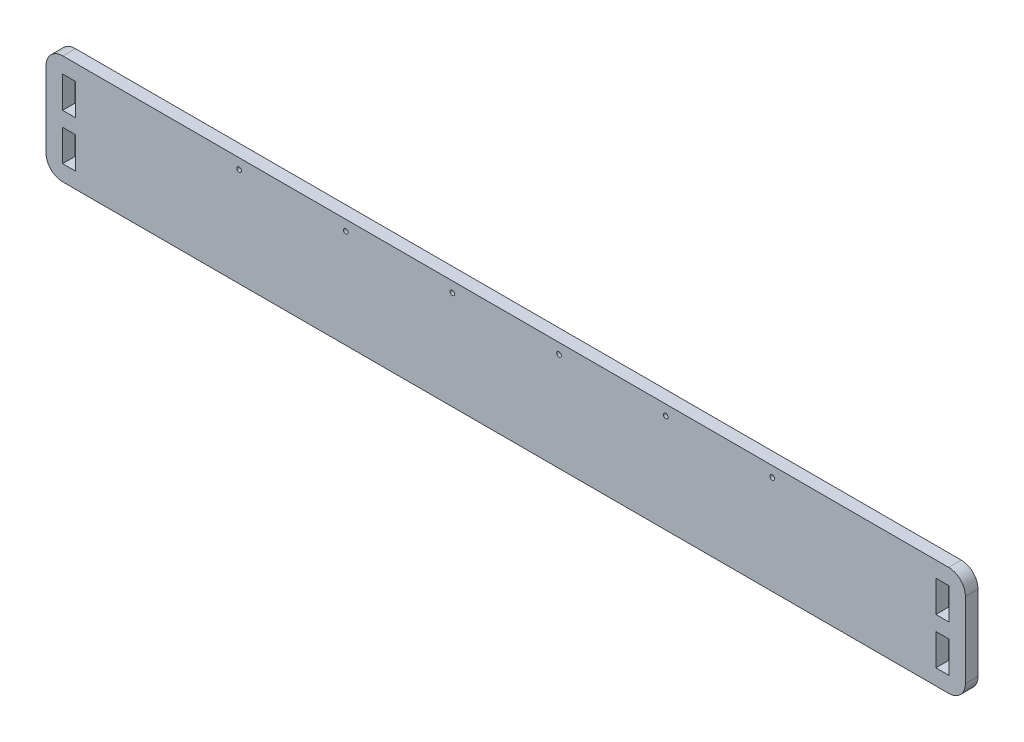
ISO-10303-21;
HEADER;
FILE_DESCRIPTION(('STEP AP214'),'2;1');
FILE_NAME('part.step','',(''),(''),'','','');
FILE_SCHEMA(('AUTOMOTIVE_DESIGN { 1 0 10303 214 1 1 1 1 }'));
ENDSEC;
DATA;
#1=APPLICATION_CONTEXT('core data for automotive mechanical design processes');
#2=APPLICATION_PROTOCOL_DEFINITION('international standard','automotive_design',2000,#1);
#3=PRODUCT_CONTEXT('',#1,'mechanical');
#4=PRODUCT('Part','Part','',(#3));
#5=PRODUCT_RELATED_PRODUCT_CATEGORY('part','',(#4));
#6=PRODUCT_DEFINITION_FORMATION('','',#4);
#7=PRODUCT_DEFINITION_CONTEXT('part definition',#1,'design');
#8=PRODUCT_DEFINITION('design','',#6,#7);
#9=PRODUCT_DEFINITION_SHAPE('','',#8);
#10=(LENGTH_UNIT() NAMED_UNIT(*) SI_UNIT(.MILLI.,.METRE.));
#11=(NAMED_UNIT(*) PLANE_ANGLE_UNIT() SI_UNIT($,.RADIAN.));
#12=(NAMED_UNIT(*) SI_UNIT($,.STERADIAN.) SOLID_ANGLE_UNIT());
#13=UNCERTAINTY_MEASURE_WITH_UNIT(LENGTH_MEASURE(1.E-05),#10,'distance_accuracy_value','');
#14=(GEOMETRIC_REPRESENTATION_CONTEXT(3) GLOBAL_UNCERTAINTY_ASSIGNED_CONTEXT((#13)) GLOBAL_UNIT_ASSIGNED_CONTEXT((#10,
#11,#12)) REPRESENTATION_CONTEXT('',''));
#15=CARTESIAN_POINT('',(0.,0.,0.));
#16=DIRECTION('',(0.,0.,1.));
#17=DIRECTION('',(1.,0.,0.));
#18=AXIS2_PLACEMENT_3D('',#15,#16,#17);
#19=CARTESIAN_POINT('',(-219.,60.,6.));
#20=DIRECTION('',(1.,0.,0.));
#21=DIRECTION('',(0.,0.,-1.));
#22=AXIS2_PLACEMENT_3D('',#19,#20,#21);
#23=PLANE('',#22);
#24=DIRECTION('',(0.,-1.,0.));
#25=VECTOR('',#24,1.);
#26=CARTESIAN_POINT('',(-219.,60.,0.));
#27=LINE('',#26,#25);
#28=CARTESIAN_POINT('',(-219.,52.,0.));
#29=VERTEX_POINT('',#28);
#30=CARTESIAN_POINT('',(-219.,16.,0.));
#31=VERTEX_POINT('',#30);
#32=EDGE_CURVE('E335',#29,#31,#27,.T.);
#33=ORIENTED_EDGE('',*,*,#32,.T.);
#34=DIRECTION('',(0.,0.,-1.));
#35=VECTOR('',#34,1.);
#36=CARTESIAN_POINT('',(-219.,16.,6.));
#37=LINE('',#36,#35);
#38=CARTESIAN_POINT('',(-219.,16.,6.));
#39=VERTEX_POINT('',#38);
#40=EDGE_CURVE('E12',#31,#39,#37,.F.);
#41=ORIENTED_EDGE('',*,*,#40,.T.);
#42=DIRECTION('',(0.,-1.,0.));
#43=VECTOR('',#42,1.);
#44=CARTESIAN_POINT('',(-219.,60.,6.));
#45=LINE('',#44,#43);
#46=CARTESIAN_POINT('',(-219.,52.,6.));
#47=VERTEX_POINT('',#46);
#48=EDGE_CURVE('E342',#47,#39,#45,.T.);
#49=ORIENTED_EDGE('',*,*,#48,.F.);
#50=DIRECTION('',(0.,0.,-1.));
#51=VECTOR('',#50,1.);
#52=CARTESIAN_POINT('',(-219.,52.,6.));
#53=LINE('',#52,#51);
#54=EDGE_CURVE('E44',#47,#29,#53,.T.);
#55=ORIENTED_EDGE('',*,*,#54,.T.);
#56=EDGE_LOOP('',(#33,#41,#49,#55));
#57=FACE_BOUND('',#56,.T.);
#58=ADVANCED_FACE('F36',(#57),#23,.F.);
#59=CARTESIAN_POINT('',(-219.,7.99999999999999,6.));
#60=DIRECTION('',(0.,1.,0.));
#61=DIRECTION('',(0.,0.,1.));
#62=AXIS2_PLACEMENT_3D('',#59,#60,#61);
#63=PLANE('',#62);
#64=DIRECTION('',(1.,0.,0.));
#65=VECTOR('',#64,1.);
#66=CARTESIAN_POINT('',(-219.,7.99999999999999,0.));
#67=LINE('',#66,#65);
#68=CARTESIAN_POINT('',(-211.,7.99999999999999,0.));
#69=VERTEX_POINT('',#68);
#70=CARTESIAN_POINT('',(211.,7.99999999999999,0.));
#71=VERTEX_POINT('',#70);
#72=EDGE_CURVE('E356',#69,#71,#67,.T.);
#73=ORIENTED_EDGE('',*,*,#72,.T.);
#74=DIRECTION('',(0.,0.,-1.));
#75=VECTOR('',#74,1.);
#76=CARTESIAN_POINT('',(211.,7.99999999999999,6.));
#77=LINE('',#76,#75);
#78=CARTESIAN_POINT('',(211.,7.99999999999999,6.));
#79=VERTEX_POINT('',#78);
#80=EDGE_CURVE('E51',#71,#79,#77,.F.);
#81=ORIENTED_EDGE('',*,*,#80,.T.);
#82=DIRECTION('',(1.,0.,0.));
#83=VECTOR('',#82,1.);
#84=CARTESIAN_POINT('',(-219.,7.99999999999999,6.));
#85=LINE('',#84,#83);
#86=CARTESIAN_POINT('',(-211.,7.99999999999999,6.));
#87=VERTEX_POINT('',#86);
#88=EDGE_CURVE('E344',#87,#79,#85,.T.);
#89=ORIENTED_EDGE('',*,*,#88,.F.);
#90=DIRECTION('',(0.,0.,-1.));
#91=VECTOR('',#90,1.);
#92=CARTESIAN_POINT('',(-211.,7.99999999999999,6.));
#93=LINE('',#92,#91);
#94=EDGE_CURVE('E387',#87,#69,#93,.T.);
#95=ORIENTED_EDGE('',*,*,#94,.T.);
#96=EDGE_LOOP('',(#73,#81,#89,#95));
#97=FACE_BOUND('',#96,.T.);
#98=ADVANCED_FACE('F404',(#97),#63,.F.);
#99=CARTESIAN_POINT('',(219.,60.,6.));
#100=DIRECTION('',(-1.,0.,0.));
#101=DIRECTION('',(0.,0.,1.));
#102=AXIS2_PLACEMENT_3D('',#99,#100,#101);
#103=PLANE('',#102);
#104=DIRECTION('',(0.,1.,0.));
#105=VECTOR('',#104,1.);
#106=CARTESIAN_POINT('',(219.,60.,0.));
#107=LINE('',#106,#105);
#108=CARTESIAN_POINT('',(219.,16.,0.));
#109=VERTEX_POINT('',#108);
#110=CARTESIAN_POINT('',(219.,52.,0.));
#111=VERTEX_POINT('',#110);
#112=EDGE_CURVE('E358',#109,#111,#107,.T.);
#113=ORIENTED_EDGE('',*,*,#112,.T.);
#114=DIRECTION('',(0.,0.,-1.));
#115=VECTOR('',#114,1.);
#116=CARTESIAN_POINT('',(219.,52.,6.));
#117=LINE('',#116,#115);
#118=CARTESIAN_POINT('',(219.,52.,6.));
#119=VERTEX_POINT('',#118);
#120=EDGE_CURVE('E378',#111,#119,#117,.F.);
#121=ORIENTED_EDGE('',*,*,#120,.T.);
#122=DIRECTION('',(0.,1.,0.));
#123=VECTOR('',#122,1.);
#124=CARTESIAN_POINT('',(219.,60.,6.));
#125=LINE('',#124,#123);
#126=CARTESIAN_POINT('',(219.,16.,6.));
#127=VERTEX_POINT('',#126);
#128=EDGE_CURVE('E347',#127,#119,#125,.T.);
#129=ORIENTED_EDGE('',*,*,#128,.F.);
#130=DIRECTION('',(0.,0.,-1.));
#131=VECTOR('',#130,1.);
#132=CARTESIAN_POINT('',(219.,16.,6.));
#133=LINE('',#132,#131);
#134=EDGE_CURVE('E375',#127,#109,#133,.T.);
#135=ORIENTED_EDGE('',*,*,#134,.T.);
#136=EDGE_LOOP('',(#113,#121,#129,#135));
#137=FACE_BOUND('',#136,.T.);
#138=ADVANCED_FACE('F413',(#137),#103,.F.);
#139=CARTESIAN_POINT('',(-219.,60.,6.));
#140=DIRECTION('',(0.,-1.,0.));
#141=DIRECTION('',(0.,0.,-1.));
#142=AXIS2_PLACEMENT_3D('',#139,#140,#141);
#143=PLANE('',#142);
#144=DIRECTION('',(-1.,0.,0.));
#145=VECTOR('',#144,1.);
#146=CARTESIAN_POINT('',(-219.,60.,6.));
#147=LINE('',#146,#145);
#148=CARTESIAN_POINT('',(211.,60.,6.));
#149=VERTEX_POINT('',#148);
#150=CARTESIAN_POINT('',(-211.,60.,6.));
#151=VERTEX_POINT('',#150);
#152=EDGE_CURVE('E350',#149,#151,#147,.T.);
#153=ORIENTED_EDGE('',*,*,#152,.F.);
#154=DIRECTION('',(0.,0.,-1.));
#155=VECTOR('',#154,1.);
#156=CARTESIAN_POINT('',(211.,60.,6.));
#157=LINE('',#156,#155);
#158=CARTESIAN_POINT('',(211.,60.,0.));
#159=VERTEX_POINT('',#158);
#160=EDGE_CURVE('E364',#149,#159,#157,.T.);
#161=ORIENTED_EDGE('',*,*,#160,.T.);
#162=DIRECTION('',(-1.,0.,0.));
#163=VECTOR('',#162,1.);
#164=CARTESIAN_POINT('',(-219.,60.,0.));
#165=LINE('',#164,#163);
#166=CARTESIAN_POINT('',(-211.,60.,0.));
#167=VERTEX_POINT('',#166);
#168=EDGE_CURVE('E345',#159,#167,#165,.T.);
#169=ORIENTED_EDGE('',*,*,#168,.T.);
#170=DIRECTION('',(0.,0.,-1.));
#171=VECTOR('',#170,1.);
#172=CARTESIAN_POINT('',(-211.,60.,6.));
#173=LINE('',#172,#171);
#174=EDGE_CURVE('E353',#167,#151,#173,.F.);
#175=ORIENTED_EDGE('',*,*,#174,.T.);
#176=EDGE_LOOP('',(#153,#161,#169,#175));
#177=FACE_BOUND('',#176,.T.);
#178=ADVANCED_FACE('F421',(#177),#143,.F.);
#179=CARTESIAN_POINT('',(0.,0.,6.));
#180=DIRECTION('',(0.,0.,1.));
#181=DIRECTION('',(1.,0.,0.));
#182=AXIS2_PLACEMENT_3D('',#179,#180,#181);
#183=PLANE('',#182);
#184=CARTESIAN_POINT('',(127.,55.06276,6.));
#185=DIRECTION('',(0.,0.,-1.));
#186=DIRECTION('',(-1.,0.,0.));
#187=AXIS2_PLACEMENT_3D('',#184,#185,#186);
#188=CIRCLE('',#187,1.09999999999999);
#189=CARTESIAN_POINT('',(125.9,55.06276,6.));
#190=VERTEX_POINT('',#189);
#191=EDGE_CURVE('E295',#190,#190,#188,.T.);
#192=ORIENTED_EDGE('',*,*,#191,.T.);
#193=EDGE_LOOP('',(#192));
#194=FACE_BOUND('',#193,.T.);
#195=CARTESIAN_POINT('',(76.2,55.06276,6.));
#196=DIRECTION('',(0.,0.,-1.));
#197=DIRECTION('',(-1.,0.,0.));
#198=AXIS2_PLACEMENT_3D('',#195,#196,#197);
#199=CIRCLE('',#198,1.10000000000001);
#200=CARTESIAN_POINT('',(75.1,55.06276,6.));
#201=VERTEX_POINT('',#200);
#202=EDGE_CURVE('E757',#201,#201,#199,.T.);
#203=ORIENTED_EDGE('',*,*,#202,.T.);
#204=EDGE_LOOP('',(#203));
#205=FACE_BOUND('',#204,.T.);
#206=CARTESIAN_POINT('',(25.4,55.06276,6.));
#207=DIRECTION('',(0.,0.,-1.));
#208=DIRECTION('',(-1.,0.,0.));
#209=AXIS2_PLACEMENT_3D('',#206,#207,#208);
#210=CIRCLE('',#209,1.10000000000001);
#211=CARTESIAN_POINT('',(24.3,55.06276,6.));
#212=VERTEX_POINT('',#211);
#213=EDGE_CURVE('E766',#212,#212,#210,.T.);
#214=ORIENTED_EDGE('',*,*,#213,.T.);
#215=EDGE_LOOP('',(#214));
#216=FACE_BOUND('',#215,.T.);
#217=CARTESIAN_POINT('',(-25.4,55.06276,6.));
#218=DIRECTION('',(0.,0.,-1.));
#219=DIRECTION('',(-1.,0.,0.));
#220=AXIS2_PLACEMENT_3D('',#217,#218,#219);
#221=CIRCLE('',#220,1.10000000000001);
#222=CARTESIAN_POINT('',(-26.5,55.06276,6.));
#223=VERTEX_POINT('',#222);
#224=EDGE_CURVE('E772',#223,#223,#221,.T.);
#225=ORIENTED_EDGE('',*,*,#224,.T.);
#226=EDGE_LOOP('',(#225));
#227=FACE_BOUND('',#226,.T.);
#228=CARTESIAN_POINT('',(-76.2,55.06276,6.));
#229=DIRECTION('',(0.,0.,-1.));
#230=DIRECTION('',(-1.,0.,0.));
#231=AXIS2_PLACEMENT_3D('',#228,#229,#230);
#232=CIRCLE('',#231,1.10000000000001);
#233=CARTESIAN_POINT('',(-77.3,55.06276,6.));
#234=VERTEX_POINT('',#233);
#235=EDGE_CURVE('E778',#234,#234,#232,.T.);
#236=ORIENTED_EDGE('',*,*,#235,.T.);
#237=EDGE_LOOP('',(#236));
#238=FACE_BOUND('',#237,.T.);
#239=CARTESIAN_POINT('',(-127.,55.06276,6.));
#240=DIRECTION('',(0.,0.,-1.));
#241=DIRECTION('',(-1.,0.,0.));
#242=AXIS2_PLACEMENT_3D('',#239,#240,#241);
#243=CIRCLE('',#242,1.10000000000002);
#244=CARTESIAN_POINT('',(-128.1,55.06276,6.));
#245=VERTEX_POINT('',#244);
#246=EDGE_CURVE('E783',#245,#245,#243,.T.);
#247=ORIENTED_EDGE('',*,*,#246,.T.);
#248=EDGE_LOOP('',(#247));
#249=FACE_BOUND('',#248,.T.);
#250=DIRECTION('',(1.,0.,0.));
#251=VECTOR('',#250,1.);
#252=CARTESIAN_POINT('',(211.1,37.5,5.99999999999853));
#253=LINE('',#252,#251);
#254=CARTESIAN_POINT('',(204.9,37.5,5.99999999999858));
#255=VERTEX_POINT('',#254);
#256=CARTESIAN_POINT('',(211.1,37.5,6.));
#257=VERTEX_POINT('',#256);
#258=EDGE_CURVE('E292',#255,#257,#253,.T.);
#259=ORIENTED_EDGE('',*,*,#258,.F.);
#260=DIRECTION('',(0.,-1.,0.));
#261=VECTOR('',#260,1.);
#262=CARTESIAN_POINT('',(204.9,37.5,5.99999999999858));
#263=LINE('',#262,#261);
#264=CARTESIAN_POINT('',(204.9,52.5,5.99999999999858));
#265=VERTEX_POINT('',#264);
#266=EDGE_CURVE('E282',#265,#255,#263,.T.);
#267=ORIENTED_EDGE('',*,*,#266,.F.);
#268=DIRECTION('',(-1.,0.,0.));
#269=VECTOR('',#268,1.);
#270=CARTESIAN_POINT('',(204.9,52.5,5.99999999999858));
#271=LINE('',#270,#269);
#272=CARTESIAN_POINT('',(211.1,52.5,5.99999999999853));
#273=VERTEX_POINT('',#272);
#274=EDGE_CURVE('E298',#273,#265,#271,.T.);
#275=ORIENTED_EDGE('',*,*,#274,.F.);
#276=DIRECTION('',(0.,1.,0.));
#277=VECTOR('',#276,1.);
#278=CARTESIAN_POINT('',(211.1,52.5,5.99999999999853));
#279=LINE('',#278,#277);
#280=EDGE_CURVE('E294',#257,#273,#279,.T.);
#281=ORIENTED_EDGE('',*,*,#280,.F.);
#282=EDGE_LOOP('',(#259,#267,#275,#281));
#283=FACE_BOUND('',#282,.T.);
#284=DIRECTION('',(1.,0.,0.));
#285=VECTOR('',#284,1.);
#286=CARTESIAN_POINT('',(211.1,15.5,5.99999999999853));
#287=LINE('',#286,#285);
#288=CARTESIAN_POINT('',(204.9,15.5,5.99999999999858));
#289=VERTEX_POINT('',#288);
#290=CARTESIAN_POINT('',(211.1,15.5,6.));
#291=VERTEX_POINT('',#290);
#292=EDGE_CURVE('E260',#289,#291,#287,.T.);
#293=ORIENTED_EDGE('',*,*,#292,.F.);
#294=DIRECTION('',(0.,-1.,0.));
#295=VECTOR('',#294,1.);
#296=CARTESIAN_POINT('',(204.9,15.5,5.99999999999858));
#297=LINE('',#296,#295);
#298=CARTESIAN_POINT('',(204.9,30.5,5.99999999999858));
#299=VERTEX_POINT('',#298);
#300=EDGE_CURVE('E250',#299,#289,#297,.T.);
#301=ORIENTED_EDGE('',*,*,#300,.F.);
#302=DIRECTION('',(-1.,0.,0.));
#303=VECTOR('',#302,1.);
#304=CARTESIAN_POINT('',(204.9,30.5,5.99999999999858));
#305=LINE('',#304,#303);
#306=CARTESIAN_POINT('',(211.1,30.5,5.99999999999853));
#307=VERTEX_POINT('',#306);
#308=EDGE_CURVE('E266',#307,#299,#305,.T.);
#309=ORIENTED_EDGE('',*,*,#308,.F.);
#310=DIRECTION('',(0.,1.,0.));
#311=VECTOR('',#310,1.);
#312=CARTESIAN_POINT('',(211.1,30.5,5.99999999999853));
#313=LINE('',#312,#311);
#314=EDGE_CURVE('E262',#291,#307,#313,.T.);
#315=ORIENTED_EDGE('',*,*,#314,.F.);
#316=EDGE_LOOP('',(#293,#301,#309,#315));
#317=FACE_BOUND('',#316,.T.);
#318=DIRECTION('',(1.,0.,0.));
#319=VECTOR('',#318,1.);
#320=CARTESIAN_POINT('',(-211.1,15.5,6.));
#321=LINE('',#320,#319);
#322=CARTESIAN_POINT('',(-211.1,15.5,6.));
#323=VERTEX_POINT('',#322);
#324=CARTESIAN_POINT('',(-204.9,15.5,6.));
#325=VERTEX_POINT('',#324);
#326=EDGE_CURVE('E205',#323,#325,#321,.T.);
#327=ORIENTED_EDGE('',*,*,#326,.F.);
#328=DIRECTION('',(0.,-1.,0.));
#329=VECTOR('',#328,1.);
#330=CARTESIAN_POINT('',(-211.1,30.5,6.));
#331=LINE('',#330,#329);
#332=CARTESIAN_POINT('',(-211.1,30.5,6.));
#333=VERTEX_POINT('',#332);
#334=EDGE_CURVE('E223',#333,#323,#331,.T.);
#335=ORIENTED_EDGE('',*,*,#334,.F.);
#336=DIRECTION('',(-1.,0.,0.));
#337=VECTOR('',#336,1.);
#338=CARTESIAN_POINT('',(-204.9,30.5,6.));
#339=LINE('',#338,#337);
#340=CARTESIAN_POINT('',(-204.9,30.5,6.));
#341=VERTEX_POINT('',#340);
#342=EDGE_CURVE('E226',#341,#333,#339,.T.);
#343=ORIENTED_EDGE('',*,*,#342,.F.);
#344=DIRECTION('',(0.,1.,0.));
#345=VECTOR('',#344,1.);
#346=CARTESIAN_POINT('',(-204.9,15.5,6.));
#347=LINE('',#346,#345);
#348=EDGE_CURVE('E235',#325,#341,#347,.T.);
#349=ORIENTED_EDGE('',*,*,#348,.F.);
#350=EDGE_LOOP('',(#327,#335,#343,#349));
#351=FACE_BOUND('',#350,.T.);
#352=DIRECTION('',(1.,0.,0.));
#353=VECTOR('',#352,1.);
#354=CARTESIAN_POINT('',(-211.1,37.5,6.));
#355=LINE('',#354,#353);
#356=CARTESIAN_POINT('',(-211.1,37.5,6.));
#357=VERTEX_POINT('',#356);
#358=CARTESIAN_POINT('',(-204.9,37.5,6.));
#359=VERTEX_POINT('',#358);
#360=EDGE_CURVE('E242',#357,#359,#355,.T.);
#361=ORIENTED_EDGE('',*,*,#360,.F.);
#362=DIRECTION('',(0.,-1.,0.));
#363=VECTOR('',#362,1.);
#364=CARTESIAN_POINT('',(-211.1,52.5,6.));
#365=LINE('',#364,#363);
#366=CARTESIAN_POINT('',(-211.1,52.5,6.));
#367=VERTEX_POINT('',#366);
#368=EDGE_CURVE('E314',#367,#357,#365,.T.);
#369=ORIENTED_EDGE('',*,*,#368,.F.);
#370=DIRECTION('',(-1.,0.,0.));
#371=VECTOR('',#370,1.);
#372=CARTESIAN_POINT('',(-204.9,52.5,6.));
#373=LINE('',#372,#371);
#374=CARTESIAN_POINT('',(-204.9,52.5,6.));
#375=VERTEX_POINT('',#374);
#376=EDGE_CURVE('E328',#375,#367,#373,.T.);
#377=ORIENTED_EDGE('',*,*,#376,.F.);
#378=DIRECTION('',(0.,1.,0.));
#379=VECTOR('',#378,1.);
#380=CARTESIAN_POINT('',(-204.9,37.5,6.));
#381=LINE('',#380,#379);
#382=EDGE_CURVE('E325',#359,#375,#381,.T.);
#383=ORIENTED_EDGE('',*,*,#382,.F.);
#384=EDGE_LOOP('',(#361,#369,#377,#383));
#385=FACE_BOUND('',#384,.T.);
#386=ORIENTED_EDGE('',*,*,#128,.T.);
#387=CARTESIAN_POINT('',(211.,52.,6.));
#388=DIRECTION('',(0.,0.,1.));
#389=DIRECTION('',(1.,0.,0.));
#390=AXIS2_PLACEMENT_3D('',#387,#388,#389);
#391=CIRCLE('',#390,8.);
#392=EDGE_CURVE('E385',#119,#149,#391,.T.);
#393=ORIENTED_EDGE('',*,*,#392,.T.);
#394=ORIENTED_EDGE('',*,*,#152,.T.);
#395=CARTESIAN_POINT('',(-211.,52.,6.));
#396=DIRECTION('',(0.,0.,1.));
#397=DIRECTION('',(1.,0.,0.));
#398=AXIS2_PLACEMENT_3D('',#395,#396,#397);
#399=CIRCLE('',#398,8.);
#400=EDGE_CURVE('E380',#151,#47,#399,.T.);
#401=ORIENTED_EDGE('',*,*,#400,.T.);
#402=ORIENTED_EDGE('',*,*,#48,.T.);
#403=CARTESIAN_POINT('',(-211.,16.,6.));
#404=DIRECTION('',(0.,0.,1.));
#405=DIRECTION('',(1.,0.,0.));
#406=AXIS2_PLACEMENT_3D('',#403,#404,#405);
#407=CIRCLE('',#406,8.);
#408=EDGE_CURVE('E58',#39,#87,#407,.T.);
#409=ORIENTED_EDGE('',*,*,#408,.T.);
#410=ORIENTED_EDGE('',*,*,#88,.T.);
#411=CARTESIAN_POINT('',(211.,16.,6.));
#412=DIRECTION('',(0.,0.,1.));
#413=DIRECTION('',(1.,0.,0.));
#414=AXIS2_PLACEMENT_3D('',#411,#412,#413);
#415=CIRCLE('',#414,8.);
#416=EDGE_CURVE('E383',#79,#127,#415,.T.);
#417=ORIENTED_EDGE('',*,*,#416,.T.);
#418=EDGE_LOOP('',(#386,#393,#394,#401,#402,#409,#410,#417));
#419=FACE_BOUND('',#418,.T.);
#420=ADVANCED_FACE('F406',(#194,#205,#216,#227,#238,#249,#283,#317,#351,#385,#419),#183,.T.);
#421=CARTESIAN_POINT('',(0.,0.,0.));
#422=DIRECTION('',(0.,0.,1.));
#423=DIRECTION('',(1.,0.,0.));
#424=AXIS2_PLACEMENT_3D('',#421,#422,#423);
#425=PLANE('',#424);
#426=CARTESIAN_POINT('',(127.,55.06276,0.));
#427=DIRECTION('',(0.,0.,-1.));
#428=DIRECTION('',(-1.,0.,0.));
#429=AXIS2_PLACEMENT_3D('',#426,#427,#428);
#430=CIRCLE('',#429,1.09999999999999);
#431=CARTESIAN_POINT('',(125.9,55.06276,0.));
#432=VERTEX_POINT('',#431);
#433=EDGE_CURVE('E756',#432,#432,#430,.T.);
#434=ORIENTED_EDGE('',*,*,#433,.F.);
#435=EDGE_LOOP('',(#434));
#436=FACE_BOUND('',#435,.T.);
#437=CARTESIAN_POINT('',(76.2,55.06276,0.));
#438=DIRECTION('',(0.,0.,-1.));
#439=DIRECTION('',(-1.,0.,0.));
#440=AXIS2_PLACEMENT_3D('',#437,#438,#439);
#441=CIRCLE('',#440,1.10000000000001);
#442=CARTESIAN_POINT('',(75.1,55.06276,0.));
#443=VERTEX_POINT('',#442);
#444=EDGE_CURVE('E761',#443,#443,#441,.T.);
#445=ORIENTED_EDGE('',*,*,#444,.F.);
#446=EDGE_LOOP('',(#445));
#447=FACE_BOUND('',#446,.T.);
#448=CARTESIAN_POINT('',(25.4,55.06276,0.));
#449=DIRECTION('',(0.,0.,-1.));
#450=DIRECTION('',(-1.,0.,0.));
#451=AXIS2_PLACEMENT_3D('',#448,#449,#450);
#452=CIRCLE('',#451,1.10000000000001);
#453=CARTESIAN_POINT('',(24.3,55.06276,0.));
#454=VERTEX_POINT('',#453);
#455=EDGE_CURVE('E769',#454,#454,#452,.T.);
#456=ORIENTED_EDGE('',*,*,#455,.F.);
#457=EDGE_LOOP('',(#456));
#458=FACE_BOUND('',#457,.T.);
#459=CARTESIAN_POINT('',(-25.4,55.06276,0.));
#460=DIRECTION('',(0.,0.,-1.));
#461=DIRECTION('',(-1.,0.,0.));
#462=AXIS2_PLACEMENT_3D('',#459,#460,#461);
#463=CIRCLE('',#462,1.10000000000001);
#464=CARTESIAN_POINT('',(-26.5,55.06276,0.));
#465=VERTEX_POINT('',#464);
#466=EDGE_CURVE('E775',#465,#465,#463,.T.);
#467=ORIENTED_EDGE('',*,*,#466,.F.);
#468=EDGE_LOOP('',(#467));
#469=FACE_BOUND('',#468,.T.);
#470=CARTESIAN_POINT('',(-76.2,55.06276,0.));
#471=DIRECTION('',(0.,0.,-1.));
#472=DIRECTION('',(-1.,0.,0.));
#473=AXIS2_PLACEMENT_3D('',#470,#471,#472);
#474=CIRCLE('',#473,1.10000000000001);
#475=CARTESIAN_POINT('',(-77.3,55.06276,0.));
#476=VERTEX_POINT('',#475);
#477=EDGE_CURVE('E781',#476,#476,#474,.T.);
#478=ORIENTED_EDGE('',*,*,#477,.F.);
#479=EDGE_LOOP('',(#478));
#480=FACE_BOUND('',#479,.T.);
#481=CARTESIAN_POINT('',(-127.,55.06276,0.));
#482=DIRECTION('',(0.,0.,-1.));
#483=DIRECTION('',(-1.,0.,0.));
#484=AXIS2_PLACEMENT_3D('',#481,#482,#483);
#485=CIRCLE('',#484,1.10000000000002);
#486=CARTESIAN_POINT('',(-128.1,55.06276,0.));
#487=VERTEX_POINT('',#486);
#488=EDGE_CURVE('E229',#487,#487,#485,.T.);
#489=ORIENTED_EDGE('',*,*,#488,.F.);
#490=EDGE_LOOP('',(#489));
#491=FACE_BOUND('',#490,.T.);
#492=DIRECTION('',(0.,-1.,0.));
#493=VECTOR('',#492,1.);
#494=CARTESIAN_POINT('',(204.9,37.5,-1.42420797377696E-12));
#495=LINE('',#494,#493);
#496=CARTESIAN_POINT('',(204.9,52.5,-1.42420797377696E-12));
#497=VERTEX_POINT('',#496);
#498=CARTESIAN_POINT('',(204.9,37.5,-1.42420797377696E-12));
#499=VERTEX_POINT('',#498);
#500=EDGE_CURVE('E288',#497,#499,#495,.T.);
#501=ORIENTED_EDGE('',*,*,#500,.T.);
#502=DIRECTION('',(1.,0.,0.));
#503=VECTOR('',#502,1.);
#504=CARTESIAN_POINT('',(211.1,37.5,-1.46757606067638E-12));
#505=LINE('',#504,#503);
#506=CARTESIAN_POINT('',(211.1,37.5,-1.46757606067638E-12));
#507=VERTEX_POINT('',#506);
#508=EDGE_CURVE('E278',#499,#507,#505,.T.);
#509=ORIENTED_EDGE('',*,*,#508,.T.);
#510=DIRECTION('',(0.,1.,0.));
#511=VECTOR('',#510,1.);
#512=CARTESIAN_POINT('',(211.1,52.5,-1.46757606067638E-12));
#513=LINE('',#512,#511);
#514=CARTESIAN_POINT('',(211.1,52.5,0.));
#515=VERTEX_POINT('',#514);
#516=EDGE_CURVE('E281',#507,#515,#513,.T.);
#517=ORIENTED_EDGE('',*,*,#516,.T.);
#518=DIRECTION('',(-1.,0.,0.));
#519=VECTOR('',#518,1.);
#520=CARTESIAN_POINT('',(204.9,52.5,-1.42420797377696E-12));
#521=LINE('',#520,#519);
#522=EDGE_CURVE('E285',#515,#497,#521,.T.);
#523=ORIENTED_EDGE('',*,*,#522,.T.);
#524=EDGE_LOOP('',(#501,#509,#517,#523));
#525=FACE_BOUND('',#524,.T.);
#526=DIRECTION('',(0.,-1.,0.));
#527=VECTOR('',#526,1.);
#528=CARTESIAN_POINT('',(204.9,15.5,-1.42420797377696E-12));
#529=LINE('',#528,#527);
#530=CARTESIAN_POINT('',(204.9,30.5,-1.42420797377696E-12));
#531=VERTEX_POINT('',#530);
#532=CARTESIAN_POINT('',(204.9,15.5,-1.42420797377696E-12));
#533=VERTEX_POINT('',#532);
#534=EDGE_CURVE('E256',#531,#533,#529,.T.);
#535=ORIENTED_EDGE('',*,*,#534,.T.);
#536=DIRECTION('',(1.,0.,0.));
#537=VECTOR('',#536,1.);
#538=CARTESIAN_POINT('',(211.1,15.5,-1.46757606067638E-12));
#539=LINE('',#538,#537);
#540=CARTESIAN_POINT('',(211.1,15.5,-1.46757606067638E-12));
#541=VERTEX_POINT('',#540);
#542=EDGE_CURVE('E246',#533,#541,#539,.T.);
#543=ORIENTED_EDGE('',*,*,#542,.T.);
#544=DIRECTION('',(0.,1.,0.));
#545=VECTOR('',#544,1.);
#546=CARTESIAN_POINT('',(211.1,30.5,-1.46757606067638E-12));
#547=LINE('',#546,#545);
#548=CARTESIAN_POINT('',(211.1,30.5,0.));
#549=VERTEX_POINT('',#548);
#550=EDGE_CURVE('E249',#541,#549,#547,.T.);
#551=ORIENTED_EDGE('',*,*,#550,.T.);
#552=DIRECTION('',(-1.,0.,0.));
#553=VECTOR('',#552,1.);
#554=CARTESIAN_POINT('',(204.9,30.5,-1.42420797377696E-12));
#555=LINE('',#554,#553);
#556=EDGE_CURVE('E253',#549,#531,#555,.T.);
#557=ORIENTED_EDGE('',*,*,#556,.T.);
#558=EDGE_LOOP('',(#535,#543,#551,#557));
#559=FACE_BOUND('',#558,.T.);
#560=DIRECTION('',(0.,-1.,0.));
#561=VECTOR('',#560,1.);
#562=CARTESIAN_POINT('',(-211.1,30.5,0.));
#563=LINE('',#562,#561);
#564=CARTESIAN_POINT('',(-211.1,30.5,0.));
#565=VERTEX_POINT('',#564);
#566=CARTESIAN_POINT('',(-211.1,15.5,0.));
#567=VERTEX_POINT('',#566);
#568=EDGE_CURVE('E210',#565,#567,#563,.T.);
#569=ORIENTED_EDGE('',*,*,#568,.T.);
#570=DIRECTION('',(1.,0.,0.));
#571=VECTOR('',#570,1.);
#572=CARTESIAN_POINT('',(-211.1,15.5,0.));
#573=LINE('',#572,#571);
#574=CARTESIAN_POINT('',(-204.9,15.5,0.));
#575=VERTEX_POINT('',#574);
#576=EDGE_CURVE('E202',#567,#575,#573,.T.);
#577=ORIENTED_EDGE('',*,*,#576,.T.);
#578=DIRECTION('',(0.,1.,0.));
#579=VECTOR('',#578,1.);
#580=CARTESIAN_POINT('',(-204.9,15.5,0.));
#581=LINE('',#580,#579);
#582=CARTESIAN_POINT('',(-204.9,30.5,0.));
#583=VERTEX_POINT('',#582);
#584=EDGE_CURVE('E214',#575,#583,#581,.T.);
#585=ORIENTED_EDGE('',*,*,#584,.T.);
#586=DIRECTION('',(-1.,0.,0.));
#587=VECTOR('',#586,1.);
#588=CARTESIAN_POINT('',(-204.9,30.5,0.));
#589=LINE('',#588,#587);
#590=EDGE_CURVE('E218',#583,#565,#589,.T.);
#591=ORIENTED_EDGE('',*,*,#590,.T.);
#592=EDGE_LOOP('',(#569,#577,#585,#591));
#593=FACE_BOUND('',#592,.T.);
#594=DIRECTION('',(0.,-1.,0.));
#595=VECTOR('',#594,1.);
#596=CARTESIAN_POINT('',(-211.1,52.5,0.));
#597=LINE('',#596,#595);
#598=CARTESIAN_POINT('',(-211.1,52.5,0.));
#599=VERTEX_POINT('',#598);
#600=CARTESIAN_POINT('',(-211.1,37.5,0.));
#601=VERTEX_POINT('',#600);
#602=EDGE_CURVE('E320',#599,#601,#597,.T.);
#603=ORIENTED_EDGE('',*,*,#602,.T.);
#604=DIRECTION('',(1.,0.,0.));
#605=VECTOR('',#604,1.);
#606=CARTESIAN_POINT('',(-211.1,37.5,0.));
#607=LINE('',#606,#605);
#608=CARTESIAN_POINT('',(-204.9,37.5,0.));
#609=VERTEX_POINT('',#608);
#610=EDGE_CURVE('E310',#601,#609,#607,.T.);
#611=ORIENTED_EDGE('',*,*,#610,.T.);
#612=DIRECTION('',(0.,1.,0.));
#613=VECTOR('',#612,1.);
#614=CARTESIAN_POINT('',(-204.9,37.5,0.));
#615=LINE('',#614,#613);
#616=CARTESIAN_POINT('',(-204.9,52.5,0.));
#617=VERTEX_POINT('',#616);
#618=EDGE_CURVE('E313',#609,#617,#615,.T.);
#619=ORIENTED_EDGE('',*,*,#618,.T.);
#620=DIRECTION('',(-1.,0.,0.));
#621=VECTOR('',#620,1.);
#622=CARTESIAN_POINT('',(-204.9,52.5,0.));
#623=LINE('',#622,#621);
#624=EDGE_CURVE('E317',#617,#599,#623,.T.);
#625=ORIENTED_EDGE('',*,*,#624,.T.);
#626=EDGE_LOOP('',(#603,#611,#619,#625));
#627=FACE_BOUND('',#626,.T.);
#628=ORIENTED_EDGE('',*,*,#168,.F.);
#629=CARTESIAN_POINT('',(211.,52.,0.));
#630=DIRECTION('',(0.,0.,1.));
#631=DIRECTION('',(1.,0.,0.));
#632=AXIS2_PLACEMENT_3D('',#629,#630,#631);
#633=CIRCLE('',#632,8.);
#634=EDGE_CURVE('E373',#159,#111,#633,.F.);
#635=ORIENTED_EDGE('',*,*,#634,.T.);
#636=ORIENTED_EDGE('',*,*,#112,.F.);
#637=CARTESIAN_POINT('',(211.,16.,0.));
#638=DIRECTION('',(0.,0.,1.));
#639=DIRECTION('',(1.,0.,0.));
#640=AXIS2_PLACEMENT_3D('',#637,#638,#639);
#641=CIRCLE('',#640,8.);
#642=EDGE_CURVE('E371',#109,#71,#641,.F.);
#643=ORIENTED_EDGE('',*,*,#642,.T.);
#644=ORIENTED_EDGE('',*,*,#72,.F.);
#645=CARTESIAN_POINT('',(-211.,16.,0.));
#646=DIRECTION('',(0.,0.,1.));
#647=DIRECTION('',(1.,0.,0.));
#648=AXIS2_PLACEMENT_3D('',#645,#646,#647);
#649=CIRCLE('',#648,8.);
#650=EDGE_CURVE('E369',#69,#31,#649,.F.);
#651=ORIENTED_EDGE('',*,*,#650,.T.);
#652=ORIENTED_EDGE('',*,*,#32,.F.);
#653=CARTESIAN_POINT('',(-211.,52.,0.));
#654=DIRECTION('',(0.,0.,1.));
#655=DIRECTION('',(1.,0.,0.));
#656=AXIS2_PLACEMENT_3D('',#653,#654,#655);
#657=CIRCLE('',#656,8.);
#658=EDGE_CURVE('E367',#29,#167,#657,.F.);
#659=ORIENTED_EDGE('',*,*,#658,.T.);
#660=EDGE_LOOP('',(#628,#635,#636,#643,#644,#651,#652,#659));
#661=FACE_BOUND('',#660,.T.);
#662=ADVANCED_FACE('F220',(#436,#447,#458,#469,#480,#491,#525,#559,#593,#627,#661),#425,.F.);
#663=CARTESIAN_POINT('',(-211.1,37.5,0.));
#664=DIRECTION('',(0.,-1.,0.));
#665=DIRECTION('',(0.,0.,-1.));
#666=AXIS2_PLACEMENT_3D('',#663,#664,#665);
#667=PLANE('',#666);
#668=ORIENTED_EDGE('',*,*,#360,.T.);
#669=DIRECTION('',(0.,0.,1.));
#670=VECTOR('',#669,1.);
#671=CARTESIAN_POINT('',(-204.9,37.5,0.));
#672=LINE('',#671,#670);
#673=EDGE_CURVE('E323',#609,#359,#672,.T.);
#674=ORIENTED_EDGE('',*,*,#673,.F.);
#675=ORIENTED_EDGE('',*,*,#610,.F.);
#676=DIRECTION('',(0.,0.,1.));
#677=VECTOR('',#676,1.);
#678=CARTESIAN_POINT('',(-211.1,37.5,0.));
#679=LINE('',#678,#677);
#680=EDGE_CURVE('E333',#601,#357,#679,.T.);
#681=ORIENTED_EDGE('',*,*,#680,.T.);
#682=EDGE_LOOP('',(#668,#674,#675,#681));
#683=FACE_BOUND('',#682,.T.);
#684=ADVANCED_FACE('F478',(#683),#667,.F.);
#685=CARTESIAN_POINT('',(-211.1,52.5,0.));
#686=DIRECTION('',(-1.,0.,0.));
#687=DIRECTION('',(0.,0.,1.));
#688=AXIS2_PLACEMENT_3D('',#685,#686,#687);
#689=PLANE('',#688);
#690=ORIENTED_EDGE('',*,*,#368,.T.);
#691=ORIENTED_EDGE('',*,*,#680,.F.);
#692=ORIENTED_EDGE('',*,*,#602,.F.);
#693=DIRECTION('',(0.,0.,1.));
#694=VECTOR('',#693,1.);
#695=CARTESIAN_POINT('',(-211.1,52.5,0.));
#696=LINE('',#695,#694);
#697=EDGE_CURVE('E336',#599,#367,#696,.T.);
#698=ORIENTED_EDGE('',*,*,#697,.T.);
#699=EDGE_LOOP('',(#690,#691,#692,#698));
#700=FACE_BOUND('',#699,.T.);
#701=ADVANCED_FACE('F585',(#700),#689,.F.);
#702=CARTESIAN_POINT('',(-204.9,52.5,0.));
#703=DIRECTION('',(0.,1.,0.));
#704=DIRECTION('',(0.,0.,1.));
#705=AXIS2_PLACEMENT_3D('',#702,#703,#704);
#706=PLANE('',#705);
#707=ORIENTED_EDGE('',*,*,#376,.T.);
#708=ORIENTED_EDGE('',*,*,#697,.F.);
#709=ORIENTED_EDGE('',*,*,#624,.F.);
#710=DIRECTION('',(0.,0.,1.));
#711=VECTOR('',#710,1.);
#712=CARTESIAN_POINT('',(-204.9,52.5,0.));
#713=LINE('',#712,#711);
#714=EDGE_CURVE('E338',#617,#375,#713,.T.);
#715=ORIENTED_EDGE('',*,*,#714,.T.);
#716=EDGE_LOOP('',(#707,#708,#709,#715));
#717=FACE_BOUND('',#716,.T.);
#718=ADVANCED_FACE('F588',(#717),#706,.F.);
#719=CARTESIAN_POINT('',(-204.9,37.5,0.));
#720=DIRECTION('',(1.,0.,0.));
#721=DIRECTION('',(0.,0.,-1.));
#722=AXIS2_PLACEMENT_3D('',#719,#720,#721);
#723=PLANE('',#722);
#724=ORIENTED_EDGE('',*,*,#382,.T.);
#725=ORIENTED_EDGE('',*,*,#714,.F.);
#726=ORIENTED_EDGE('',*,*,#618,.F.);
#727=ORIENTED_EDGE('',*,*,#673,.T.);
#728=EDGE_LOOP('',(#724,#725,#726,#727));
#729=FACE_BOUND('',#728,.T.);
#730=ADVANCED_FACE('F555',(#729),#723,.F.);
#731=CARTESIAN_POINT('',(-211.1,15.5,0.));
#732=DIRECTION('',(0.,-1.,0.));
#733=DIRECTION('',(0.,0.,-1.));
#734=AXIS2_PLACEMENT_3D('',#731,#732,#733);
#735=PLANE('',#734);
#736=ORIENTED_EDGE('',*,*,#326,.T.);
#737=DIRECTION('',(0.,0.,1.));
#738=VECTOR('',#737,1.);
#739=CARTESIAN_POINT('',(-204.9,15.5,0.));
#740=LINE('',#739,#738);
#741=EDGE_CURVE('E198',#575,#325,#740,.T.);
#742=ORIENTED_EDGE('',*,*,#741,.F.);
#743=ORIENTED_EDGE('',*,*,#576,.F.);
#744=DIRECTION('',(0.,0.,1.));
#745=VECTOR('',#744,1.);
#746=CARTESIAN_POINT('',(-211.1,15.5,0.));
#747=LINE('',#746,#745);
#748=EDGE_CURVE('E240',#567,#323,#747,.T.);
#749=ORIENTED_EDGE('',*,*,#748,.T.);
#750=EDGE_LOOP('',(#736,#742,#743,#749));
#751=FACE_BOUND('',#750,.T.);
#752=ADVANCED_FACE('F200',(#751),#735,.F.);
#753=CARTESIAN_POINT('',(-211.1,30.5,0.));
#754=DIRECTION('',(-1.,0.,0.));
#755=DIRECTION('',(0.,0.,1.));
#756=AXIS2_PLACEMENT_3D('',#753,#754,#755);
#757=PLANE('',#756);
#758=ORIENTED_EDGE('',*,*,#334,.T.);
#759=ORIENTED_EDGE('',*,*,#748,.F.);
#760=ORIENTED_EDGE('',*,*,#568,.F.);
#761=DIRECTION('',(0.,0.,1.));
#762=VECTOR('',#761,1.);
#763=CARTESIAN_POINT('',(-211.1,30.5,0.));
#764=LINE('',#763,#762);
#765=EDGE_CURVE('E243',#565,#333,#764,.T.);
#766=ORIENTED_EDGE('',*,*,#765,.T.);
#767=EDGE_LOOP('',(#758,#759,#760,#766));
#768=FACE_BOUND('',#767,.T.);
#769=ADVANCED_FACE('F542',(#768),#757,.F.);
#770=CARTESIAN_POINT('',(-204.9,30.5,0.));
#771=DIRECTION('',(0.,1.,0.));
#772=DIRECTION('',(0.,0.,1.));
#773=AXIS2_PLACEMENT_3D('',#770,#771,#772);
#774=PLANE('',#773);
#775=ORIENTED_EDGE('',*,*,#342,.T.);
#776=ORIENTED_EDGE('',*,*,#765,.F.);
#777=ORIENTED_EDGE('',*,*,#590,.F.);
#778=DIRECTION('',(0.,0.,1.));
#779=VECTOR('',#778,1.);
#780=CARTESIAN_POINT('',(-204.9,30.5,0.));
#781=LINE('',#780,#779);
#782=EDGE_CURVE('E209',#583,#341,#781,.T.);
#783=ORIENTED_EDGE('',*,*,#782,.T.);
#784=EDGE_LOOP('',(#775,#776,#777,#783));
#785=FACE_BOUND('',#784,.T.);
#786=ADVANCED_FACE('F545',(#785),#774,.F.);
#787=CARTESIAN_POINT('',(-204.9,15.5,0.));
#788=DIRECTION('',(1.,0.,0.));
#789=DIRECTION('',(0.,0.,-1.));
#790=AXIS2_PLACEMENT_3D('',#787,#788,#789);
#791=PLANE('',#790);
#792=ORIENTED_EDGE('',*,*,#348,.T.);
#793=ORIENTED_EDGE('',*,*,#782,.F.);
#794=ORIENTED_EDGE('',*,*,#584,.F.);
#795=ORIENTED_EDGE('',*,*,#741,.T.);
#796=EDGE_LOOP('',(#792,#793,#794,#795));
#797=FACE_BOUND('',#796,.T.);
#798=ADVANCED_FACE('F215',(#797),#791,.F.);
#799=CARTESIAN_POINT('',(211.1,15.5,-1.46757606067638E-12));
#800=DIRECTION('',(0.,-1.,0.));
#801=DIRECTION('',(1.,0.,0.));
#802=AXIS2_PLACEMENT_3D('',#799,#800,#801);
#803=PLANE('',#802);
#804=ORIENTED_EDGE('',*,*,#292,.T.);
#805=DIRECTION('',(0.,0.,1.));
#806=VECTOR('',#805,1.);
#807=CARTESIAN_POINT('',(211.1,15.5,-1.46757606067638E-12));
#808=LINE('',#807,#806);
#809=EDGE_CURVE('E259',#541,#291,#808,.T.);
#810=ORIENTED_EDGE('',*,*,#809,.F.);
#811=ORIENTED_EDGE('',*,*,#542,.F.);
#812=DIRECTION('',(0.,0.,1.));
#813=VECTOR('',#812,1.);
#814=CARTESIAN_POINT('',(204.9,15.5,-1.42420797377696E-12));
#815=LINE('',#814,#813);
#816=EDGE_CURVE('E236',#533,#289,#815,.T.);
#817=ORIENTED_EDGE('',*,*,#816,.T.);
#818=EDGE_LOOP('',(#804,#810,#811,#817));
#819=FACE_BOUND('',#818,.T.);
#820=ADVANCED_FACE('F552',(#819),#803,.F.);
#821=CARTESIAN_POINT('',(204.9,15.5,-1.42420797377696E-12));
#822=DIRECTION('',(-1.,0.,0.));
#823=DIRECTION('',(0.,0.,1.));
#824=AXIS2_PLACEMENT_3D('',#821,#822,#823);
#825=PLANE('',#824);
#826=ORIENTED_EDGE('',*,*,#300,.T.);
#827=ORIENTED_EDGE('',*,*,#816,.F.);
#828=ORIENTED_EDGE('',*,*,#534,.F.);
#829=DIRECTION('',(0.,0.,1.));
#830=VECTOR('',#829,1.);
#831=CARTESIAN_POINT('',(204.9,30.5,-1.42420797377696E-12));
#832=LINE('',#831,#830);
#833=EDGE_CURVE('E272',#531,#299,#832,.T.);
#834=ORIENTED_EDGE('',*,*,#833,.T.);
#835=EDGE_LOOP('',(#826,#827,#828,#834));
#836=FACE_BOUND('',#835,.T.);
#837=ADVANCED_FACE('F556',(#836),#825,.F.);
#838=CARTESIAN_POINT('',(204.9,30.5,-1.42420797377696E-12));
#839=DIRECTION('',(0.,1.,0.));
#840=DIRECTION('',(-1.,0.,0.));
#841=AXIS2_PLACEMENT_3D('',#838,#839,#840);
#842=PLANE('',#841);
#843=ORIENTED_EDGE('',*,*,#308,.T.);
#844=ORIENTED_EDGE('',*,*,#833,.F.);
#845=ORIENTED_EDGE('',*,*,#556,.F.);
#846=DIRECTION('',(0.,0.,1.));
#847=VECTOR('',#846,1.);
#848=CARTESIAN_POINT('',(211.1,30.5,-1.46757606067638E-12));
#849=LINE('',#848,#847);
#850=EDGE_CURVE('E274',#549,#307,#849,.T.);
#851=ORIENTED_EDGE('',*,*,#850,.T.);
#852=EDGE_LOOP('',(#843,#844,#845,#851));
#853=FACE_BOUND('',#852,.T.);
#854=ADVANCED_FACE('F559',(#853),#842,.F.);
#855=CARTESIAN_POINT('',(211.1,30.5,-1.46757606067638E-12));
#856=DIRECTION('',(1.,0.,0.));
#857=DIRECTION('',(0.,0.,-1.));
#858=AXIS2_PLACEMENT_3D('',#855,#856,#857);
#859=PLANE('',#858);
#860=ORIENTED_EDGE('',*,*,#314,.T.);
#861=ORIENTED_EDGE('',*,*,#850,.F.);
#862=ORIENTED_EDGE('',*,*,#550,.F.);
#863=ORIENTED_EDGE('',*,*,#809,.T.);
#864=EDGE_LOOP('',(#860,#861,#862,#863));
#865=FACE_BOUND('',#864,.T.);
#866=ADVANCED_FACE('F563',(#865),#859,.F.);
#867=CARTESIAN_POINT('',(211.1,37.5,-1.46757606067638E-12));
#868=DIRECTION('',(0.,-1.,0.));
#869=DIRECTION('',(0.,0.,-1.));
#870=AXIS2_PLACEMENT_3D('',#867,#868,#869);
#871=PLANE('',#870);
#872=ORIENTED_EDGE('',*,*,#258,.T.);
#873=DIRECTION('',(0.,0.,1.));
#874=VECTOR('',#873,1.);
#875=CARTESIAN_POINT('',(211.1,37.5,-1.46757606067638E-12));
#876=LINE('',#875,#874);
#877=EDGE_CURVE('E291',#507,#257,#876,.T.);
#878=ORIENTED_EDGE('',*,*,#877,.F.);
#879=ORIENTED_EDGE('',*,*,#508,.F.);
#880=DIRECTION('',(0.,0.,1.));
#881=VECTOR('',#880,1.);
#882=CARTESIAN_POINT('',(204.9,37.5,-1.42420797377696E-12));
#883=LINE('',#882,#881);
#884=EDGE_CURVE('E263',#499,#255,#883,.T.);
#885=ORIENTED_EDGE('',*,*,#884,.T.);
#886=EDGE_LOOP('',(#872,#878,#879,#885));
#887=FACE_BOUND('',#886,.T.);
#888=ADVANCED_FACE('F567',(#887),#871,.F.);
#889=CARTESIAN_POINT('',(204.9,37.5,-1.42420797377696E-12));
#890=DIRECTION('',(-1.,0.,0.));
#891=DIRECTION('',(0.,0.,1.));
#892=AXIS2_PLACEMENT_3D('',#889,#890,#891);
#893=PLANE('',#892);
#894=ORIENTED_EDGE('',*,*,#266,.T.);
#895=ORIENTED_EDGE('',*,*,#884,.F.);
#896=ORIENTED_EDGE('',*,*,#500,.F.);
#897=DIRECTION('',(0.,0.,1.));
#898=VECTOR('',#897,1.);
#899=CARTESIAN_POINT('',(204.9,52.5,-1.42420797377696E-12));
#900=LINE('',#899,#898);
#901=EDGE_CURVE('E304',#497,#265,#900,.T.);
#902=ORIENTED_EDGE('',*,*,#901,.T.);
#903=EDGE_LOOP('',(#894,#895,#896,#902));
#904=FACE_BOUND('',#903,.T.);
#905=ADVANCED_FACE('F572',(#904),#893,.F.);
#906=CARTESIAN_POINT('',(204.9,52.5,-1.42420797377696E-12));
#907=DIRECTION('',(0.,1.,0.));
#908=DIRECTION('',(0.,0.,1.));
#909=AXIS2_PLACEMENT_3D('',#906,#907,#908);
#910=PLANE('',#909);
#911=ORIENTED_EDGE('',*,*,#274,.T.);
#912=ORIENTED_EDGE('',*,*,#901,.F.);
#913=ORIENTED_EDGE('',*,*,#522,.F.);
#914=DIRECTION('',(0.,0.,1.));
#915=VECTOR('',#914,1.);
#916=CARTESIAN_POINT('',(211.1,52.5,-1.46757606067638E-12));
#917=LINE('',#916,#915);
#918=EDGE_CURVE('E306',#515,#273,#917,.T.);
#919=ORIENTED_EDGE('',*,*,#918,.T.);
#920=EDGE_LOOP('',(#911,#912,#913,#919));
#921=FACE_BOUND('',#920,.T.);
#922=ADVANCED_FACE('F575',(#921),#910,.F.);
#923=CARTESIAN_POINT('',(211.1,52.5,-1.46757606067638E-12));
#924=DIRECTION('',(1.,0.,0.));
#925=DIRECTION('',(0.,0.,-1.));
#926=AXIS2_PLACEMENT_3D('',#923,#924,#925);
#927=PLANE('',#926);
#928=ORIENTED_EDGE('',*,*,#280,.T.);
#929=ORIENTED_EDGE('',*,*,#918,.F.);
#930=ORIENTED_EDGE('',*,*,#516,.F.);
#931=ORIENTED_EDGE('',*,*,#877,.T.);
#932=EDGE_LOOP('',(#928,#929,#930,#931));
#933=FACE_BOUND('',#932,.T.);
#934=ADVANCED_FACE('F442',(#933),#927,.F.);
#935=CARTESIAN_POINT('',(211.,52.,6.));
#936=DIRECTION('',(0.,0.,-1.));
#937=DIRECTION('',(-1.,0.,0.));
#938=AXIS2_PLACEMENT_3D('',#935,#936,#937);
#939=CYLINDRICAL_SURFACE('',#938,8.);
#940=ORIENTED_EDGE('',*,*,#392,.F.);
#941=ORIENTED_EDGE('',*,*,#120,.F.);
#942=ORIENTED_EDGE('',*,*,#634,.F.);
#943=ORIENTED_EDGE('',*,*,#160,.F.);
#944=EDGE_LOOP('',(#940,#941,#942,#943));
#945=FACE_BOUND('',#944,.T.);
#946=ADVANCED_FACE('F418',(#945),#939,.T.);
#947=CARTESIAN_POINT('',(211.,16.,6.));
#948=DIRECTION('',(0.,0.,-1.));
#949=DIRECTION('',(-1.,0.,0.));
#950=AXIS2_PLACEMENT_3D('',#947,#948,#949);
#951=CYLINDRICAL_SURFACE('',#950,8.);
#952=ORIENTED_EDGE('',*,*,#416,.F.);
#953=ORIENTED_EDGE('',*,*,#80,.F.);
#954=ORIENTED_EDGE('',*,*,#642,.F.);
#955=ORIENTED_EDGE('',*,*,#134,.F.);
#956=EDGE_LOOP('',(#952,#953,#954,#955));
#957=FACE_BOUND('',#956,.T.);
#958=ADVANCED_FACE('F410',(#957),#951,.T.);
#959=CARTESIAN_POINT('',(-211.,16.,6.));
#960=DIRECTION('',(0.,0.,-1.));
#961=DIRECTION('',(-1.,0.,0.));
#962=AXIS2_PLACEMENT_3D('',#959,#960,#961);
#963=CYLINDRICAL_SURFACE('',#962,8.);
#964=ORIENTED_EDGE('',*,*,#408,.F.);
#965=ORIENTED_EDGE('',*,*,#40,.F.);
#966=ORIENTED_EDGE('',*,*,#650,.F.);
#967=ORIENTED_EDGE('',*,*,#94,.F.);
#968=EDGE_LOOP('',(#964,#965,#966,#967));
#969=FACE_BOUND('',#968,.T.);
#970=ADVANCED_FACE('F403',(#969),#963,.T.);
#971=CARTESIAN_POINT('',(-211.,52.,6.));
#972=DIRECTION('',(0.,0.,-1.));
#973=DIRECTION('',(-1.,0.,0.));
#974=AXIS2_PLACEMENT_3D('',#971,#972,#973);
#975=CYLINDRICAL_SURFACE('',#974,8.);
#976=ORIENTED_EDGE('',*,*,#400,.F.);
#977=ORIENTED_EDGE('',*,*,#174,.F.);
#978=ORIENTED_EDGE('',*,*,#658,.F.);
#979=ORIENTED_EDGE('',*,*,#54,.F.);
#980=EDGE_LOOP('',(#976,#977,#978,#979));
#981=FACE_BOUND('',#980,.T.);
#982=ADVANCED_FACE('F38',(#981),#975,.T.);
#983=CARTESIAN_POINT('',(-127.,55.06276,6.));
#984=DIRECTION('',(0.,0.,-1.));
#985=DIRECTION('',(-1.,0.,0.));
#986=AXIS2_PLACEMENT_3D('',#983,#984,#985);
#987=CYLINDRICAL_SURFACE('',#986,1.10000000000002);
#988=ORIENTED_EDGE('',*,*,#246,.F.);
#989=EDGE_LOOP('',(#988));
#990=FACE_BOUND('',#989,.T.);
#991=ORIENTED_EDGE('',*,*,#488,.T.);
#992=EDGE_LOOP('',(#991));
#993=FACE_BOUND('',#992,.T.);
#994=ADVANCED_FACE('F424',(#990,#993),#987,.F.);
#995=CARTESIAN_POINT('',(-76.2,55.06276,6.));
#996=DIRECTION('',(0.,0.,-1.));
#997=DIRECTION('',(-1.,0.,0.));
#998=AXIS2_PLACEMENT_3D('',#995,#996,#997);
#999=CYLINDRICAL_SURFACE('',#998,1.10000000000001);
#1000=ORIENTED_EDGE('',*,*,#235,.F.);
#1001=EDGE_LOOP('',(#1000));
#1002=FACE_BOUND('',#1001,.T.);
#1003=ORIENTED_EDGE('',*,*,#477,.T.);
#1004=EDGE_LOOP('',(#1003));
#1005=FACE_BOUND('',#1004,.T.);
#1006=ADVANCED_FACE('F429',(#1002,#1005),#999,.F.);
#1007=CARTESIAN_POINT('',(-25.4,55.06276,6.));
#1008=DIRECTION('',(0.,0.,-1.));
#1009=DIRECTION('',(-1.,0.,0.));
#1010=AXIS2_PLACEMENT_3D('',#1007,#1008,#1009);
#1011=CYLINDRICAL_SURFACE('',#1010,1.10000000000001);
#1012=ORIENTED_EDGE('',*,*,#224,.F.);
#1013=EDGE_LOOP('',(#1012));
#1014=FACE_BOUND('',#1013,.T.);
#1015=ORIENTED_EDGE('',*,*,#466,.T.);
#1016=EDGE_LOOP('',(#1015));
#1017=FACE_BOUND('',#1016,.T.);
#1018=ADVANCED_FACE('F495',(#1014,#1017),#1011,.F.);
#1019=CARTESIAN_POINT('',(25.4,55.06276,6.));
#1020=DIRECTION('',(0.,0.,-1.));
#1021=DIRECTION('',(-1.,0.,0.));
#1022=AXIS2_PLACEMENT_3D('',#1019,#1020,#1021);
#1023=CYLINDRICAL_SURFACE('',#1022,1.10000000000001);
#1024=ORIENTED_EDGE('',*,*,#213,.F.);
#1025=EDGE_LOOP('',(#1024));
#1026=FACE_BOUND('',#1025,.T.);
#1027=ORIENTED_EDGE('',*,*,#455,.T.);
#1028=EDGE_LOOP('',(#1027));
#1029=FACE_BOUND('',#1028,.T.);
#1030=ADVANCED_FACE('F505',(#1026,#1029),#1023,.F.);
#1031=CARTESIAN_POINT('',(76.2,55.06276,6.));
#1032=DIRECTION('',(0.,0.,-1.));
#1033=DIRECTION('',(-1.,0.,0.));
#1034=AXIS2_PLACEMENT_3D('',#1031,#1032,#1033);
#1035=CYLINDRICAL_SURFACE('',#1034,1.10000000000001);
#1036=ORIENTED_EDGE('',*,*,#202,.F.);
#1037=EDGE_LOOP('',(#1036));
#1038=FACE_BOUND('',#1037,.T.);
#1039=ORIENTED_EDGE('',*,*,#444,.T.);
#1040=EDGE_LOOP('',(#1039));
#1041=FACE_BOUND('',#1040,.T.);
#1042=ADVANCED_FACE('F515',(#1038,#1041),#1035,.F.);
#1043=CARTESIAN_POINT('',(127.,55.06276,6.));
#1044=DIRECTION('',(0.,0.,-1.));
#1045=DIRECTION('',(-1.,0.,0.));
#1046=AXIS2_PLACEMENT_3D('',#1043,#1044,#1045);
#1047=CYLINDRICAL_SURFACE('',#1046,1.09999999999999);
#1048=ORIENTED_EDGE('',*,*,#191,.F.);
#1049=EDGE_LOOP('',(#1048));
#1050=FACE_BOUND('',#1049,.T.);
#1051=ORIENTED_EDGE('',*,*,#433,.T.);
#1052=EDGE_LOOP('',(#1051));
#1053=FACE_BOUND('',#1052,.T.);
#1054=ADVANCED_FACE('F525',(#1050,#1053),#1047,.F.);
#1055=CLOSED_SHELL('',(#58,#98,#138,#178,#420,#662,#684,#701,#718,#730,#752,#769,#786,#798,#820,
#837,#854,#866,#888,#905,#922,#934,#946,#958,#970,#982,#994,#1006,#1018,#1030,#1042,#1054));
#1056=MANIFOLD_SOLID_BREP('B2',#1055);
#1057=ADVANCED_BREP_SHAPE_REPRESENTATION('',(#18,#1056),#14);
#1058=SHAPE_DEFINITION_REPRESENTATION(#9,#1057);
ENDSEC;
END-ISO-10303-21;
